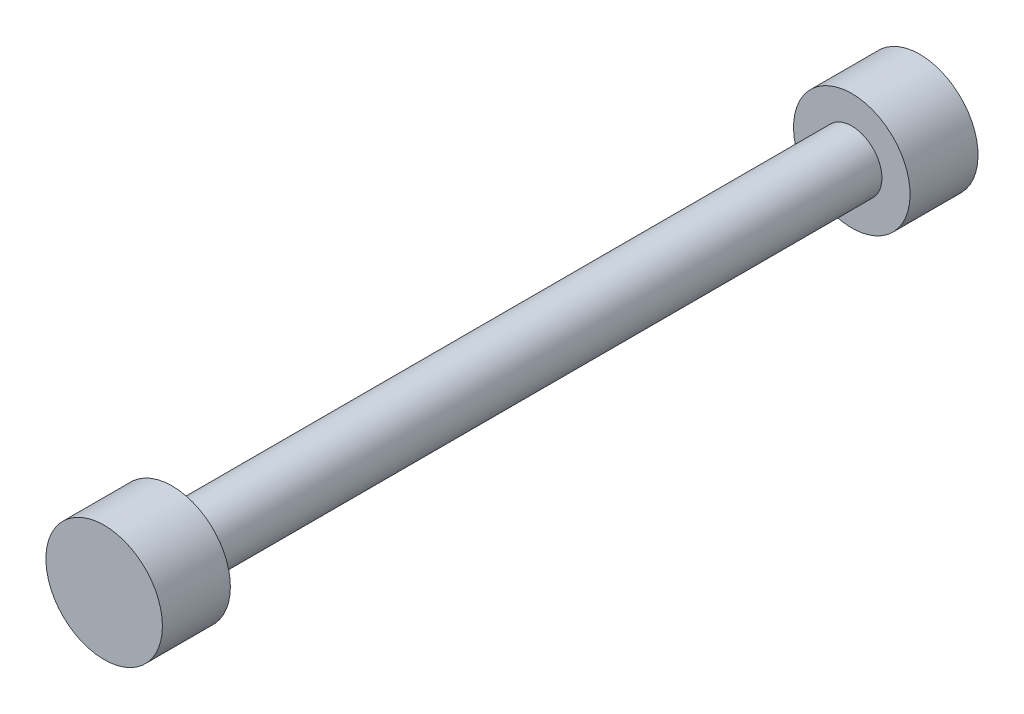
ISO-10303-21;
HEADER;
FILE_DESCRIPTION(('STEP AP214'),'2;1');
FILE_NAME('part.step','',(''),(''),'','','');
FILE_SCHEMA(('AUTOMOTIVE_DESIGN { 1 0 10303 214 1 1 1 1 }'));
ENDSEC;
DATA;
#1=APPLICATION_CONTEXT('core data for automotive mechanical design processes');
#2=APPLICATION_PROTOCOL_DEFINITION('international standard','automotive_design',2000,#1);
#3=PRODUCT_CONTEXT('',#1,'mechanical');
#4=PRODUCT('Part','Part','',(#3));
#5=PRODUCT_RELATED_PRODUCT_CATEGORY('part','',(#4));
#6=PRODUCT_DEFINITION_FORMATION('','',#4);
#7=PRODUCT_DEFINITION_CONTEXT('part definition',#1,'design');
#8=PRODUCT_DEFINITION('design','',#6,#7);
#9=PRODUCT_DEFINITION_SHAPE('','',#8);
#10=(LENGTH_UNIT() NAMED_UNIT(*) SI_UNIT(.MILLI.,.METRE.));
#11=(NAMED_UNIT(*) PLANE_ANGLE_UNIT() SI_UNIT($,.RADIAN.));
#12=(NAMED_UNIT(*) SI_UNIT($,.STERADIAN.) SOLID_ANGLE_UNIT());
#13=UNCERTAINTY_MEASURE_WITH_UNIT(LENGTH_MEASURE(1.E-05),#10,'distance_accuracy_value','');
#14=(GEOMETRIC_REPRESENTATION_CONTEXT(3) GLOBAL_UNCERTAINTY_ASSIGNED_CONTEXT((#13)) GLOBAL_UNIT_ASSIGNED_CONTEXT((#10,
#11,#12)) REPRESENTATION_CONTEXT('',''));
#15=CARTESIAN_POINT('',(0.,0.,0.));
#16=DIRECTION('',(0.,0.,1.));
#17=DIRECTION('',(1.,0.,0.));
#18=AXIS2_PLACEMENT_3D('',#15,#16,#17);
#19=CARTESIAN_POINT('',(0.,0.,-148.864081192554));
#20=DIRECTION('',(0.,0.,1.));
#21=DIRECTION('',(1.,0.,0.));
#22=AXIS2_PLACEMENT_3D('',#19,#20,#21);
#23=CYLINDRICAL_SURFACE('',#22,4.92379);
#24=CARTESIAN_POINT('',(0.,0.,-11.1125));
#25=DIRECTION('',(0.,0.,-1.));
#26=DIRECTION('',(-1.,0.,0.));
#27=AXIS2_PLACEMENT_3D('',#24,#25,#26);
#28=CIRCLE('',#27,4.92379);
#29=CARTESIAN_POINT('',(-4.92379,0.,-11.1125));
#30=VERTEX_POINT('',#29);
#31=EDGE_CURVE('E42',#30,#30,#28,.T.);
#32=ORIENTED_EDGE('',*,*,#31,.T.);
#33=EDGE_LOOP('',(#32));
#34=FACE_BOUND('',#33,.T.);
#35=CARTESIAN_POINT('',(0.,0.,-122.2375));
#36=DIRECTION('',(0.,0.,-1.));
#37=DIRECTION('',(0.,1.,0.));
#38=AXIS2_PLACEMENT_3D('',#35,#36,#37);
#39=CIRCLE('',#38,4.92379);
#40=CARTESIAN_POINT('',(0.,4.92379,-122.2375));
#41=VERTEX_POINT('',#40);
#42=EDGE_CURVE('E10',#41,#41,#39,.T.);
#43=ORIENTED_EDGE('',*,*,#42,.F.);
#44=EDGE_LOOP('',(#43));
#45=FACE_BOUND('',#44,.T.);
#46=ADVANCED_FACE('F35',(#34,#45),#23,.T.);
#47=CARTESIAN_POINT('',(0.,0.,-11.1125));
#48=DIRECTION('',(0.,0.,-1.));
#49=DIRECTION('',(-0.546944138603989,0.837169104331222,0.));
#50=AXIS2_PLACEMENT_3D('',#47,#48,#49);
#51=PLANE('',#50);
#52=ORIENTED_EDGE('',*,*,#31,.F.);
#53=EDGE_LOOP('',(#52));
#54=FACE_BOUND('',#53,.T.);
#55=CARTESIAN_POINT('',(0.,0.,-11.1125));
#56=DIRECTION('',(0.,0.,-1.));
#57=DIRECTION('',(0.,1.,0.));
#58=AXIS2_PLACEMENT_3D('',#55,#56,#57);
#59=CIRCLE('',#58,9.52500000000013);
#60=CARTESIAN_POINT('',(0.,9.52500000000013,-11.1125));
#61=VERTEX_POINT('',#60);
#62=EDGE_CURVE('E46',#61,#61,#59,.F.);
#63=ORIENTED_EDGE('',*,*,#62,.F.);
#64=EDGE_LOOP('',(#63));
#65=FACE_BOUND('',#64,.T.);
#66=ADVANCED_FACE('F37',(#54,#65),#51,.T.);
#67=CARTESIAN_POINT('',(0.,0.,0.));
#68=DIRECTION('',(0.,0.,1.));
#69=DIRECTION('',(1.,0.,0.));
#70=AXIS2_PLACEMENT_3D('',#67,#68,#69);
#71=PLANE('',#70);
#72=CARTESIAN_POINT('',(0.,0.,0.));
#73=DIRECTION('',(0.,0.,1.));
#74=DIRECTION('',(1.,0.,0.));
#75=AXIS2_PLACEMENT_3D('',#72,#73,#74);
#76=CIRCLE('',#75,9.52500000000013);
#77=CARTESIAN_POINT('',(9.52500000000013,0.,0.));
#78=VERTEX_POINT('',#77);
#79=EDGE_CURVE('E51',#78,#78,#76,.T.);
#80=ORIENTED_EDGE('',*,*,#79,.T.);
#81=EDGE_LOOP('',(#80));
#82=FACE_BOUND('',#81,.T.);
#83=ADVANCED_FACE('F94',(#82),#71,.T.);
#84=CARTESIAN_POINT('',(0.,0.,-38.0532683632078));
#85=DIRECTION('',(0.,0.,1.));
#86=DIRECTION('',(1.,0.,0.));
#87=AXIS2_PLACEMENT_3D('',#84,#85,#86);
#88=CYLINDRICAL_SURFACE('',#87,9.52500000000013);
#89=ORIENTED_EDGE('',*,*,#79,.F.);
#90=EDGE_LOOP('',(#89));
#91=FACE_BOUND('',#90,.T.);
#92=ORIENTED_EDGE('',*,*,#62,.T.);
#93=EDGE_LOOP('',(#92));
#94=FACE_BOUND('',#93,.T.);
#95=ADVANCED_FACE('F86',(#91,#94),#88,.T.);
#96=CARTESIAN_POINT('',(0.,0.,-160.29076579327));
#97=DIRECTION('',(0.,0.,1.));
#98=DIRECTION('',(0.,-1.,0.));
#99=AXIS2_PLACEMENT_3D('',#96,#97,#98);
#100=CYLINDRICAL_SURFACE('',#99,9.525);
#101=CARTESIAN_POINT('',(0.,0.,-122.2375));
#102=DIRECTION('',(0.,0.,-1.));
#103=DIRECTION('',(0.,1.,0.));
#104=AXIS2_PLACEMENT_3D('',#101,#102,#103);
#105=CIRCLE('',#104,9.525);
#106=CARTESIAN_POINT('',(0.,9.52500000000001,-122.2375));
#107=VERTEX_POINT('',#106);
#108=EDGE_CURVE('E66',#107,#107,#105,.T.);
#109=ORIENTED_EDGE('',*,*,#108,.T.);
#110=EDGE_LOOP('',(#109));
#111=FACE_BOUND('',#110,.T.);
#112=CARTESIAN_POINT('',(0.,0.,-133.349997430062));
#113=DIRECTION('',(0.,0.,-1.));
#114=DIRECTION('',(0.,1.,0.));
#115=AXIS2_PLACEMENT_3D('',#112,#113,#114);
#116=CIRCLE('',#115,9.525);
#117=CARTESIAN_POINT('',(0.,9.52500000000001,-133.349997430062));
#118=VERTEX_POINT('',#117);
#119=EDGE_CURVE('E55',#118,#118,#116,.T.);
#120=ORIENTED_EDGE('',*,*,#119,.F.);
#121=EDGE_LOOP('',(#120));
#122=FACE_BOUND('',#121,.T.);
#123=ADVANCED_FACE('F72',(#111,#122),#100,.T.);
#124=CARTESIAN_POINT('',(0.,0.,-122.2375));
#125=DIRECTION('',(0.,0.,-1.));
#126=DIRECTION('',(0.,1.,0.));
#127=AXIS2_PLACEMENT_3D('',#124,#125,#126);
#128=PLANE('',#127);
#129=ORIENTED_EDGE('',*,*,#42,.T.);
#130=EDGE_LOOP('',(#129));
#131=FACE_BOUND('',#130,.T.);
#132=ORIENTED_EDGE('',*,*,#108,.F.);
#133=EDGE_LOOP('',(#132));
#134=FACE_BOUND('',#133,.T.);
#135=ADVANCED_FACE('F75',(#131,#134),#128,.F.);
#136=CARTESIAN_POINT('',(10.4052230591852,-3.56354221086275,-133.349997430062));
#137=DIRECTION('',(0.,0.,-1.));
#138=DIRECTION('',(-0.657307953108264,0.75362209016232,0.));
#139=AXIS2_PLACEMENT_3D('',#136,#137,#138);
#140=PLANE('',#139);
#141=CARTESIAN_POINT('',(0.,0.,-133.349997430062));
#142=DIRECTION('',(0.,0.,-1.));
#143=DIRECTION('',(0.,1.,0.));
#144=AXIS2_PLACEMENT_3D('',#141,#142,#143);
#145=CIRCLE('',#144,4.92379);
#146=CARTESIAN_POINT('',(0.,4.92379,-133.349997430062));
#147=VERTEX_POINT('',#146);
#148=EDGE_CURVE('E60',#147,#147,#145,.T.);
#149=ORIENTED_EDGE('',*,*,#148,.F.);
#150=EDGE_LOOP('',(#149));
#151=FACE_BOUND('',#150,.T.);
#152=ORIENTED_EDGE('',*,*,#119,.T.);
#153=EDGE_LOOP('',(#152));
#154=FACE_BOUND('',#153,.T.);
#155=ADVANCED_FACE('F77',(#151,#154),#140,.T.);
#156=CARTESIAN_POINT('',(0.,0.,-134.9375));
#157=DIRECTION('',(0.,0.,-1.));
#158=DIRECTION('',(-1.,0.,0.));
#159=AXIS2_PLACEMENT_3D('',#156,#157,#158);
#160=PLANE('',#159);
#161=CARTESIAN_POINT('',(0.,0.,-134.9375));
#162=DIRECTION('',(0.,0.,-1.));
#163=DIRECTION('',(-1.,0.,0.));
#164=AXIS2_PLACEMENT_3D('',#161,#162,#163);
#165=CIRCLE('',#164,4.92379);
#166=CARTESIAN_POINT('',(-4.92379,0.,-134.9375));
#167=VERTEX_POINT('',#166);
#168=EDGE_CURVE('E57',#167,#167,#165,.T.);
#169=ORIENTED_EDGE('',*,*,#168,.T.);
#170=EDGE_LOOP('',(#169));
#171=FACE_BOUND('',#170,.T.);
#172=ADVANCED_FACE('F83',(#171),#160,.T.);
#173=ORIENTED_EDGE('',*,*,#148,.T.);
#174=EDGE_LOOP('',(#173));
#175=FACE_BOUND('',#174,.T.);
#176=ORIENTED_EDGE('',*,*,#168,.F.);
#177=EDGE_LOOP('',(#176));
#178=FACE_BOUND('',#177,.T.);
#179=ADVANCED_FACE('F90',(#175,#178),#23,.T.);
#180=CLOSED_SHELL('',(#46,#66,#83,#95,#123,#135,#155,#172,#179));
#181=MANIFOLD_SOLID_BREP('B2',#180);
#182=ADVANCED_BREP_SHAPE_REPRESENTATION('',(#18,#181),#14);
#183=SHAPE_DEFINITION_REPRESENTATION(#9,#182);
ENDSEC;
END-ISO-10303-21;
